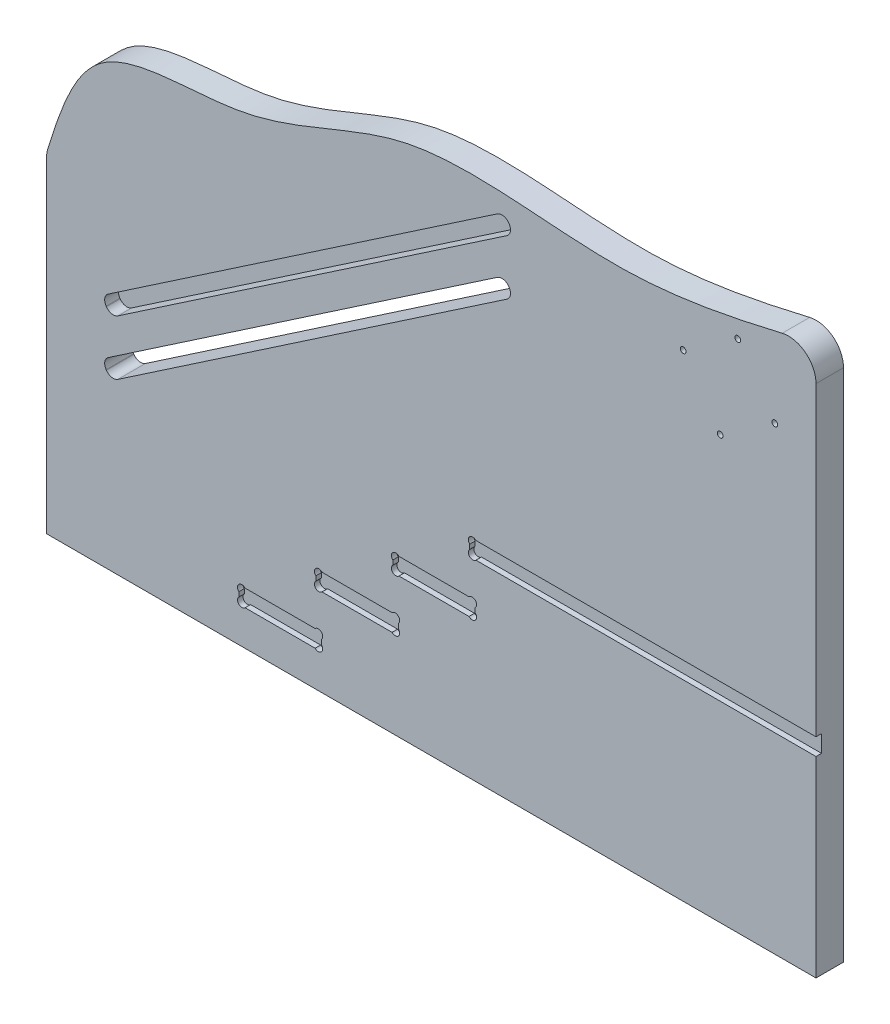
from build123d import *

# Parameters (mm, degrees)
EXTRUSION1_DEPTH        = 10
CONG_1_R                = 10
ESQUISSE2_W             = 30
ESQUISSE2_H             = 6.2
ESQUISSE2_W_2           = 126
ENL_V_MAT_EXTRU_1_DEPTH = 2
ENL_V_MAT_EXTRU_2_DEPTH = 10
ENL_V_MAT_EXTRU_3_DEPTH = 5
CONG_2_R                = 3
ESQUISSE5_R             = 1.05
ENL_V_MAT_EXTRU_4_DEPTH = 10
ESQUISSE6_R             = 1.6
ENL_V_MAT_EXTRU_5_DEPTH = 2


with BuildPart() as part:
    # Esquisse1 → Extrusion1 (new body)
    with BuildSketch(Plane.XY):
        with BuildLine():
            Line((-80, 71.678648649), (-80, -48.321351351))
            Line((-80, -48.321351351), (200, -48.321351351))
            Line((200, -48.321351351), (200, 151.678648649))
            add(Edge.make_bspline(
                [(-80, 71.678648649), (-75.201520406, 87.066109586), (-64.742723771, 120.604717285), (-2.764560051, 114.401511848), (53.106649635, 150.407436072), (127.862897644, 134.103874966), (176.932927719, 146.058814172), (200, 151.678648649)],
                knots=[0, 0, 0, 0, 0.140150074, 0.305471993, 0.510528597, 0.769906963, 1, 1, 1, 1], degree=3))
        make_face()
    extrude(amount=EXTRUSION1_DEPTH)

    # Cong_1
    cong_1_edges = [part.edges().sort_by_distance(p)[0] for p in [
        (200, 151.678648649, 5),
        (-80, 71.678648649, 5),
    ]]
    fillet(cong_1_edges, radius=CONG_1_R)

    # Esquisse2 → Enl_v. mat.-Extru.1 (cut)
    with BuildSketch(Plane.XY.offset(10)):
        with Locations((5, -32.421351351)):
            Rectangle(ESQUISSE2_W, ESQUISSE2_H)
        with Locations((33, -13.421351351)):
            Rectangle(ESQUISSE2_W, ESQUISSE2_H)
        with Locations((61, 5.578648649)):
            Rectangle(ESQUISSE2_W, ESQUISSE2_H)
        with Locations((137, 24.578648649)):
            Rectangle(ESQUISSE2_W_2, ESQUISSE2_H)
    extrude(amount=-ENL_V_MAT_EXTRU_1_DEPTH, mode=Mode.SUBTRACT)

    # Esquisse3 → Enl_v. mat.-Extru.2 (cut)
    with BuildSketch(Plane.XY.offset(10)):
        Polygon((-56.518691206, 11.62206954), (90, 111.045467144), (86.518691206, 116.175816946), (-60, 16.752419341), align=None)
    extrude(amount=-ENL_V_MAT_EXTRU_2_DEPTH, mode=Mode.SUBTRACT)

    # Esquisse4 → Enl_v. mat.-Extru.3 (cut)
    with BuildSketch(Plane.XY.offset(10)):
        Polygon((-56.518691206, 31.634740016), (90, 131.058137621), (86.518691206, 136.188487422), (-60, 36.765089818), align=None)
    extrude(amount=-ENL_V_MAT_EXTRU_3_DEPTH, mode=Mode.SUBTRACT)

    # Cong_2
    cong_2_edges = [part.edges().sort_by_distance(p)[0] for p in [
        (-56.518691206, 11.62206954, 5),
        (-60, 16.752419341, 5),
        (86.518691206, 116.175816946, 5),
        (90, 111.045467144, 5),
        (-56.518691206, 31.634740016, 7.5),
        (-60, 36.765089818, 7.5),
        (86.518691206, 136.188487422, 7.5),
        (90, 131.058137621, 7.5),
    ]]
    fillet(cong_2_edges, radius=CONG_2_R)

    # Esquisse5 → Enl_v. mat.-Extru.4 (cut)
    with BuildSketch(Plane.XY.offset(10)):
        with Locations((151.664513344, 125.363450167)):
            Circle(ESQUISSE5_R)
        with Locations((171.523860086, 138.839590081)):
            Circle(ESQUISSE5_R)
        with Locations((165.140653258, 105.504103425)):
            Circle(ESQUISSE5_R)
        with Locations((185, 118.980243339)):
            Circle(ESQUISSE5_R)
    extrude(amount=-ENL_V_MAT_EXTRU_4_DEPTH, mode=Mode.SUBTRACT)

    # Esquisse6 → Enl_v. mat.-Extru.5 (cut)
    with BuildSketch(Plane.XY.offset(10)):
        with Locations((-8.9, -30.421351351)):
            Circle(ESQUISSE6_R)
        with Locations((-8.9, -34.421351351)):
            Circle(ESQUISSE6_R)
        with Locations((18.9, -34.421351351)):
            Circle(ESQUISSE6_R)
        with Locations((18.9, -30.421351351)):
            Circle(ESQUISSE6_R)
        with Locations((19.1, -11.421351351)):
            Circle(ESQUISSE6_R)
        with Locations((19.1, -15.421351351)):
            Circle(ESQUISSE6_R)
        with Locations((46.9, -15.421351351)):
            Circle(ESQUISSE6_R)
        with Locations((46.9, -11.421351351)):
            Circle(ESQUISSE6_R)
        with Locations((47.1, 7.578648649)):
            Circle(ESQUISSE6_R)
        with Locations((47.1, 3.578648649)):
            Circle(ESQUISSE6_R)
        with Locations((74.9, 3.578648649)):
            Circle(ESQUISSE6_R)
        with Locations((74.9, 7.578648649)):
            Circle(ESQUISSE6_R)
        with Locations((75.1, 26.578648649)):
            Circle(ESQUISSE6_R)
        with Locations((75.1, 22.578648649)):
            Circle(ESQUISSE6_R)
    extrude(amount=-ENL_V_MAT_EXTRU_5_DEPTH, mode=Mode.SUBTRACT)


solid = part.part
